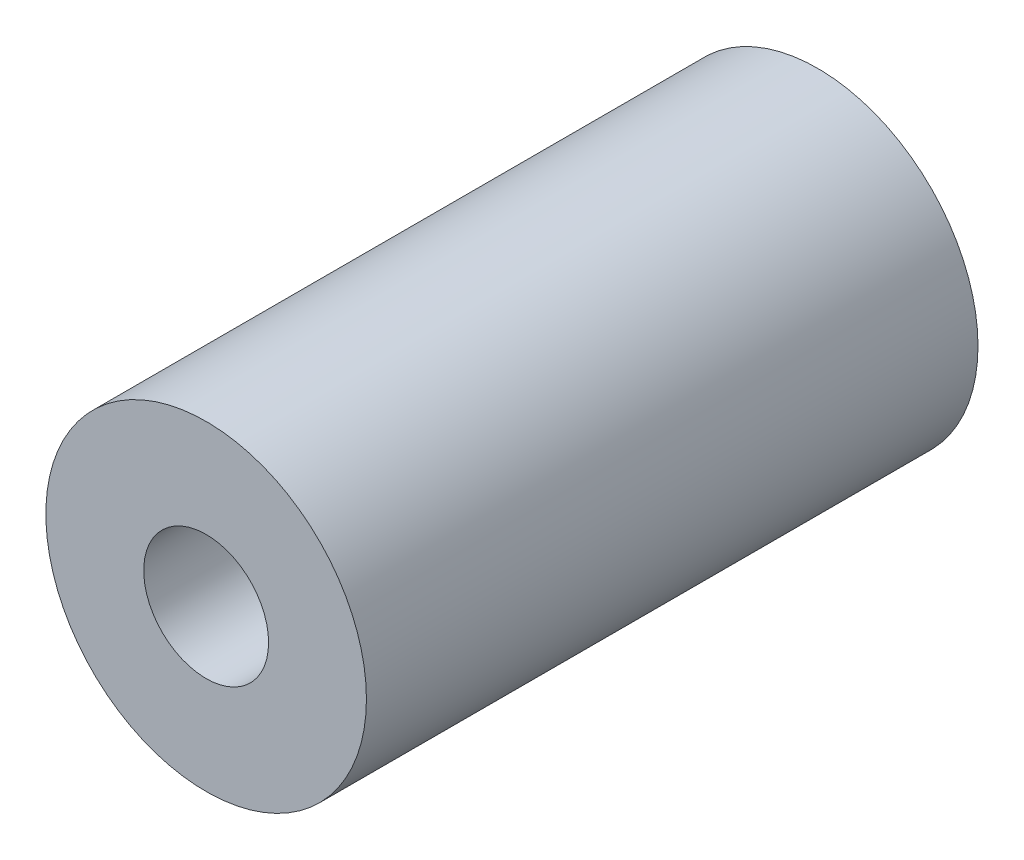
from build123d import *

# Parameters (mm, degrees)
SKETCH1_R           = 6.5527
SKETCH1_R_2         = 2.5527
BOSS_EXTRUDE1_DEPTH = 12.5


with BuildPart() as part:
    # Sketch1 → Boss-Extrude1 (new, symmetric)
    with BuildSketch(Plane.XY):
        Circle(SKETCH1_R)
        Circle(SKETCH1_R_2, mode=Mode.SUBTRACT)
    extrude(amount=BOSS_EXTRUDE1_DEPTH, both=True)


solid = part.part
